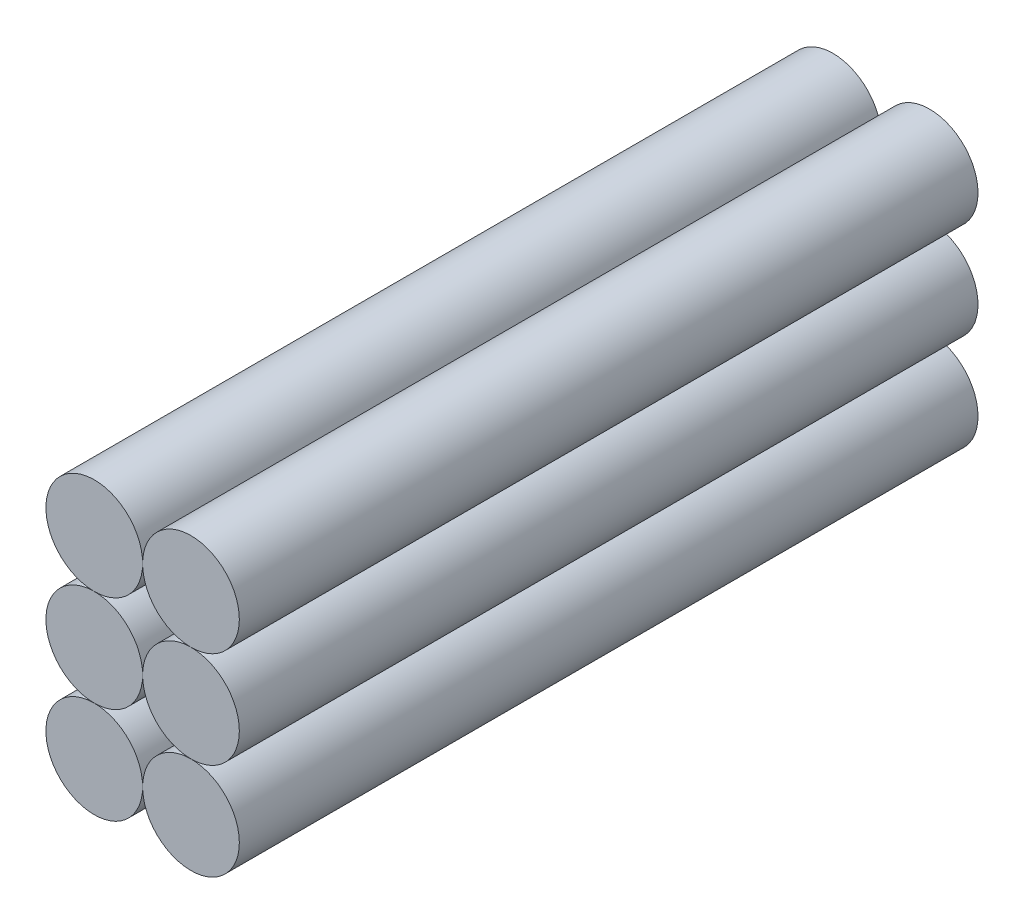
ISO-10303-21;
HEADER;
FILE_DESCRIPTION(('STEP AP214'),'2;1');
FILE_NAME('part.step','',(''),(''),'','','');
FILE_SCHEMA(('AUTOMOTIVE_DESIGN { 1 0 10303 214 1 1 1 1 }'));
ENDSEC;
DATA;
#1=APPLICATION_CONTEXT('core data for automotive mechanical design processes');
#2=APPLICATION_PROTOCOL_DEFINITION('international standard','automotive_design',2000,#1);
#3=PRODUCT_CONTEXT('',#1,'mechanical');
#4=PRODUCT('Part','Part','',(#3));
#5=PRODUCT_RELATED_PRODUCT_CATEGORY('part','',(#4));
#6=PRODUCT_DEFINITION_FORMATION('','',#4);
#7=PRODUCT_DEFINITION_CONTEXT('part definition',#1,'design');
#8=PRODUCT_DEFINITION('design','',#6,#7);
#9=PRODUCT_DEFINITION_SHAPE('','',#8);
#10=(LENGTH_UNIT() NAMED_UNIT(*) SI_UNIT(.MILLI.,.METRE.));
#11=(NAMED_UNIT(*) PLANE_ANGLE_UNIT() SI_UNIT($,.RADIAN.));
#12=(NAMED_UNIT(*) SI_UNIT($,.STERADIAN.) SOLID_ANGLE_UNIT());
#13=UNCERTAINTY_MEASURE_WITH_UNIT(LENGTH_MEASURE(1.E-05),#10,'distance_accuracy_value','');
#14=(GEOMETRIC_REPRESENTATION_CONTEXT(3) GLOBAL_UNCERTAINTY_ASSIGNED_CONTEXT((#13)) GLOBAL_UNIT_ASSIGNED_CONTEXT((#10,
#11,#12)) REPRESENTATION_CONTEXT('',''));
#15=CARTESIAN_POINT('',(0.,0.,0.));
#16=DIRECTION('',(0.,0.,1.));
#17=DIRECTION('',(1.,0.,0.));
#18=AXIS2_PLACEMENT_3D('',#15,#16,#17);
#19=CARTESIAN_POINT('',(8.9789,-17.9578,68.58));
#20=DIRECTION('',(0.,0.,-1.));
#21=DIRECTION('',(-1.,0.,0.));
#22=AXIS2_PLACEMENT_3D('',#19,#20,#21);
#23=CYLINDRICAL_SURFACE('',#22,8.9789);
#24=CARTESIAN_POINT('',(8.9789,-17.9578,68.58));
#25=DIRECTION('',(0.,0.,1.));
#26=DIRECTION('',(1.,0.,0.));
#27=AXIS2_PLACEMENT_3D('',#24,#25,#26);
#28=CIRCLE('',#27,8.9789);
#29=CARTESIAN_POINT('',(17.9578,-17.9578,68.58));
#30=VERTEX_POINT('',#29);
#31=EDGE_CURVE('E12',#30,#30,#28,.T.);
#32=ORIENTED_EDGE('',*,*,#31,.F.);
#33=EDGE_LOOP('',(#32));
#34=FACE_BOUND('',#33,.T.);
#35=CARTESIAN_POINT('',(8.9789,-17.9578,-68.58));
#36=DIRECTION('',(0.,0.,1.));
#37=DIRECTION('',(1.,0.,0.));
#38=AXIS2_PLACEMENT_3D('',#35,#36,#37);
#39=CIRCLE('',#38,8.9789);
#40=CARTESIAN_POINT('',(17.9578,-17.9578,-68.58));
#41=VERTEX_POINT('',#40);
#42=EDGE_CURVE('E52',#41,#41,#39,.T.);
#43=ORIENTED_EDGE('',*,*,#42,.T.);
#44=EDGE_LOOP('',(#43));
#45=FACE_BOUND('',#44,.T.);
#46=ADVANCED_FACE('F49',(#34,#45),#23,.T.);
#47=CARTESIAN_POINT('',(0.,0.,68.58));
#48=DIRECTION('',(0.,0.,1.));
#49=DIRECTION('',(1.,0.,0.));
#50=AXIS2_PLACEMENT_3D('',#47,#48,#49);
#51=PLANE('',#50);
#52=ORIENTED_EDGE('',*,*,#31,.T.);
#53=EDGE_LOOP('',(#52));
#54=FACE_BOUND('',#53,.T.);
#55=ADVANCED_FACE('F64',(#54),#51,.T.);
#56=CARTESIAN_POINT('',(0.,0.,-68.58));
#57=DIRECTION('',(0.,0.,1.));
#58=DIRECTION('',(1.,0.,0.));
#59=AXIS2_PLACEMENT_3D('',#56,#57,#58);
#60=PLANE('',#59);
#61=ORIENTED_EDGE('',*,*,#42,.F.);
#62=EDGE_LOOP('',(#61));
#63=FACE_BOUND('',#62,.T.);
#64=ADVANCED_FACE('F62',(#63),#60,.F.);
#65=CLOSED_SHELL('',(#46,#55,#64));
#66=MANIFOLD_SOLID_BREP('B2',#65);
#67=CARTESIAN_POINT('',(-8.9789,-17.9578,68.58));
#68=DIRECTION('',(0.,0.,-1.));
#69=DIRECTION('',(-1.,0.,0.));
#70=AXIS2_PLACEMENT_3D('',#67,#68,#69);
#71=CYLINDRICAL_SURFACE('',#70,8.9789);
#72=CARTESIAN_POINT('',(-8.9789,-17.9578,68.58));
#73=DIRECTION('',(0.,0.,1.));
#74=DIRECTION('',(1.,0.,0.));
#75=AXIS2_PLACEMENT_3D('',#72,#73,#74);
#76=CIRCLE('',#75,8.9789);
#77=CARTESIAN_POINT('',(0.,-17.9578,68.58));
#78=VERTEX_POINT('',#77);
#79=EDGE_CURVE('E48',#78,#78,#76,.T.);
#80=ORIENTED_EDGE('',*,*,#79,.F.);
#81=EDGE_LOOP('',(#80));
#82=FACE_BOUND('',#81,.T.);
#83=CARTESIAN_POINT('',(-8.9789,-17.9578,-68.58));
#84=DIRECTION('',(0.,0.,1.));
#85=DIRECTION('',(1.,0.,0.));
#86=AXIS2_PLACEMENT_3D('',#83,#84,#85);
#87=CIRCLE('',#86,8.9789);
#88=CARTESIAN_POINT('',(0.,-17.9578,-68.58));
#89=VERTEX_POINT('',#88);
#90=EDGE_CURVE('E100',#89,#89,#87,.T.);
#91=ORIENTED_EDGE('',*,*,#90,.T.);
#92=EDGE_LOOP('',(#91));
#93=FACE_BOUND('',#92,.T.);
#94=ADVANCED_FACE('F97',(#82,#93),#71,.T.);
#95=CARTESIAN_POINT('',(0.,0.,68.58));
#96=DIRECTION('',(0.,0.,1.));
#97=DIRECTION('',(1.,0.,0.));
#98=AXIS2_PLACEMENT_3D('',#95,#96,#97);
#99=PLANE('',#98);
#100=ORIENTED_EDGE('',*,*,#79,.T.);
#101=EDGE_LOOP('',(#100));
#102=FACE_BOUND('',#101,.T.);
#103=ADVANCED_FACE('F112',(#102),#99,.T.);
#104=CARTESIAN_POINT('',(0.,0.,-68.58));
#105=DIRECTION('',(0.,0.,1.));
#106=DIRECTION('',(1.,0.,0.));
#107=AXIS2_PLACEMENT_3D('',#104,#105,#106);
#108=PLANE('',#107);
#109=ORIENTED_EDGE('',*,*,#90,.F.);
#110=EDGE_LOOP('',(#109));
#111=FACE_BOUND('',#110,.T.);
#112=ADVANCED_FACE('F110',(#111),#108,.F.);
#113=CLOSED_SHELL('',(#94,#103,#112));
#114=MANIFOLD_SOLID_BREP('B7',#113);
#115=CARTESIAN_POINT('',(-8.9789,0.,68.58));
#116=DIRECTION('',(0.,0.,-1.));
#117=DIRECTION('',(-1.,0.,0.));
#118=AXIS2_PLACEMENT_3D('',#115,#116,#117);
#119=CYLINDRICAL_SURFACE('',#118,8.9789);
#120=CARTESIAN_POINT('',(-8.9789,0.,68.58));
#121=DIRECTION('',(0.,0.,1.));
#122=DIRECTION('',(1.,0.,0.));
#123=AXIS2_PLACEMENT_3D('',#120,#121,#122);
#124=CIRCLE('',#123,8.9789);
#125=CARTESIAN_POINT('',(0.,0.,68.58));
#126=VERTEX_POINT('',#125);
#127=EDGE_CURVE('E96',#126,#126,#124,.T.);
#128=ORIENTED_EDGE('',*,*,#127,.F.);
#129=EDGE_LOOP('',(#128));
#130=FACE_BOUND('',#129,.T.);
#131=CARTESIAN_POINT('',(-8.9789,0.,-68.58));
#132=DIRECTION('',(0.,0.,1.));
#133=DIRECTION('',(1.,0.,0.));
#134=AXIS2_PLACEMENT_3D('',#131,#132,#133);
#135=CIRCLE('',#134,8.9789);
#136=CARTESIAN_POINT('',(0.,0.,-68.58));
#137=VERTEX_POINT('',#136);
#138=EDGE_CURVE('E148',#137,#137,#135,.T.);
#139=ORIENTED_EDGE('',*,*,#138,.T.);
#140=EDGE_LOOP('',(#139));
#141=FACE_BOUND('',#140,.T.);
#142=ADVANCED_FACE('F145',(#130,#141),#119,.T.);
#143=CARTESIAN_POINT('',(0.,0.,68.58));
#144=DIRECTION('',(0.,0.,1.));
#145=DIRECTION('',(1.,0.,0.));
#146=AXIS2_PLACEMENT_3D('',#143,#144,#145);
#147=PLANE('',#146);
#148=ORIENTED_EDGE('',*,*,#127,.T.);
#149=EDGE_LOOP('',(#148));
#150=FACE_BOUND('',#149,.T.);
#151=ADVANCED_FACE('F160',(#150),#147,.T.);
#152=CARTESIAN_POINT('',(0.,0.,-68.58));
#153=DIRECTION('',(0.,0.,1.));
#154=DIRECTION('',(1.,0.,0.));
#155=AXIS2_PLACEMENT_3D('',#152,#153,#154);
#156=PLANE('',#155);
#157=ORIENTED_EDGE('',*,*,#138,.F.);
#158=EDGE_LOOP('',(#157));
#159=FACE_BOUND('',#158,.T.);
#160=ADVANCED_FACE('F158',(#159),#156,.F.);
#161=CLOSED_SHELL('',(#142,#151,#160));
#162=MANIFOLD_SOLID_BREP('B43',#161);
#163=CARTESIAN_POINT('',(8.9789,0.,68.58));
#164=DIRECTION('',(0.,0.,-1.));
#165=DIRECTION('',(-1.,0.,0.));
#166=AXIS2_PLACEMENT_3D('',#163,#164,#165);
#167=CYLINDRICAL_SURFACE('',#166,8.9789);
#168=CARTESIAN_POINT('',(8.9789,0.,68.58));
#169=DIRECTION('',(0.,0.,1.));
#170=DIRECTION('',(1.,0.,0.));
#171=AXIS2_PLACEMENT_3D('',#168,#169,#170);
#172=CIRCLE('',#171,8.9789);
#173=CARTESIAN_POINT('',(17.9578,0.,68.58));
#174=VERTEX_POINT('',#173);
#175=EDGE_CURVE('E144',#174,#174,#172,.T.);
#176=ORIENTED_EDGE('',*,*,#175,.F.);
#177=EDGE_LOOP('',(#176));
#178=FACE_BOUND('',#177,.T.);
#179=CARTESIAN_POINT('',(8.9789,0.,-68.58));
#180=DIRECTION('',(0.,0.,1.));
#181=DIRECTION('',(1.,0.,0.));
#182=AXIS2_PLACEMENT_3D('',#179,#180,#181);
#183=CIRCLE('',#182,8.9789);
#184=CARTESIAN_POINT('',(17.9578,0.,-68.58));
#185=VERTEX_POINT('',#184);
#186=EDGE_CURVE('E196',#185,#185,#183,.T.);
#187=ORIENTED_EDGE('',*,*,#186,.T.);
#188=EDGE_LOOP('',(#187));
#189=FACE_BOUND('',#188,.T.);
#190=ADVANCED_FACE('F193',(#178,#189),#167,.T.);
#191=CARTESIAN_POINT('',(0.,0.,68.58));
#192=DIRECTION('',(0.,0.,1.));
#193=DIRECTION('',(1.,0.,0.));
#194=AXIS2_PLACEMENT_3D('',#191,#192,#193);
#195=PLANE('',#194);
#196=ORIENTED_EDGE('',*,*,#175,.T.);
#197=EDGE_LOOP('',(#196));
#198=FACE_BOUND('',#197,.T.);
#199=ADVANCED_FACE('F208',(#198),#195,.T.);
#200=CARTESIAN_POINT('',(0.,0.,-68.58));
#201=DIRECTION('',(0.,0.,1.));
#202=DIRECTION('',(1.,0.,0.));
#203=AXIS2_PLACEMENT_3D('',#200,#201,#202);
#204=PLANE('',#203);
#205=ORIENTED_EDGE('',*,*,#186,.F.);
#206=EDGE_LOOP('',(#205));
#207=FACE_BOUND('',#206,.T.);
#208=ADVANCED_FACE('F206',(#207),#204,.F.);
#209=CLOSED_SHELL('',(#190,#199,#208));
#210=MANIFOLD_SOLID_BREP('B91',#209);
#211=CARTESIAN_POINT('',(8.9789,17.9578,68.58));
#212=DIRECTION('',(0.,0.,-1.));
#213=DIRECTION('',(-1.,0.,0.));
#214=AXIS2_PLACEMENT_3D('',#211,#212,#213);
#215=CYLINDRICAL_SURFACE('',#214,8.9789);
#216=CARTESIAN_POINT('',(8.9789,17.9578,68.58));
#217=DIRECTION('',(0.,0.,1.));
#218=DIRECTION('',(1.,0.,0.));
#219=AXIS2_PLACEMENT_3D('',#216,#217,#218);
#220=CIRCLE('',#219,8.9789);
#221=CARTESIAN_POINT('',(17.9578,17.9578,68.58));
#222=VERTEX_POINT('',#221);
#223=EDGE_CURVE('E192',#222,#222,#220,.T.);
#224=ORIENTED_EDGE('',*,*,#223,.F.);
#225=EDGE_LOOP('',(#224));
#226=FACE_BOUND('',#225,.T.);
#227=CARTESIAN_POINT('',(8.9789,17.9578,-68.58));
#228=DIRECTION('',(0.,0.,1.));
#229=DIRECTION('',(1.,0.,0.));
#230=AXIS2_PLACEMENT_3D('',#227,#228,#229);
#231=CIRCLE('',#230,8.9789);
#232=CARTESIAN_POINT('',(17.9578,17.9578,-68.58));
#233=VERTEX_POINT('',#232);
#234=EDGE_CURVE('E243',#233,#233,#231,.T.);
#235=ORIENTED_EDGE('',*,*,#234,.T.);
#236=EDGE_LOOP('',(#235));
#237=FACE_BOUND('',#236,.T.);
#238=ADVANCED_FACE('F240',(#226,#237),#215,.T.);
#239=CARTESIAN_POINT('',(0.,0.,68.58));
#240=DIRECTION('',(0.,0.,1.));
#241=DIRECTION('',(1.,0.,0.));
#242=AXIS2_PLACEMENT_3D('',#239,#240,#241);
#243=PLANE('',#242);
#244=ORIENTED_EDGE('',*,*,#223,.T.);
#245=EDGE_LOOP('',(#244));
#246=FACE_BOUND('',#245,.T.);
#247=ADVANCED_FACE('F255',(#246),#243,.T.);
#248=CARTESIAN_POINT('',(0.,0.,-68.58));
#249=DIRECTION('',(0.,0.,1.));
#250=DIRECTION('',(1.,0.,0.));
#251=AXIS2_PLACEMENT_3D('',#248,#249,#250);
#252=PLANE('',#251);
#253=ORIENTED_EDGE('',*,*,#234,.F.);
#254=EDGE_LOOP('',(#253));
#255=FACE_BOUND('',#254,.T.);
#256=ADVANCED_FACE('F253',(#255),#252,.F.);
#257=CLOSED_SHELL('',(#238,#247,#256));
#258=MANIFOLD_SOLID_BREP('B139',#257);
#259=CARTESIAN_POINT('',(-8.9789,17.9578,68.58));
#260=DIRECTION('',(0.,0.,-1.));
#261=DIRECTION('',(-1.,0.,0.));
#262=AXIS2_PLACEMENT_3D('',#259,#260,#261);
#263=CYLINDRICAL_SURFACE('',#262,8.9789);
#264=CARTESIAN_POINT('',(-8.9789,17.9578,68.58));
#265=DIRECTION('',(0.,0.,1.));
#266=DIRECTION('',(1.,0.,0.));
#267=AXIS2_PLACEMENT_3D('',#264,#265,#266);
#268=CIRCLE('',#267,8.9789);
#269=CARTESIAN_POINT('',(0.,17.9578,68.58));
#270=VERTEX_POINT('',#269);
#271=EDGE_CURVE('E239',#270,#270,#268,.T.);
#272=ORIENTED_EDGE('',*,*,#271,.F.);
#273=EDGE_LOOP('',(#272));
#274=FACE_BOUND('',#273,.T.);
#275=CARTESIAN_POINT('',(-8.9789,17.9578,-68.58));
#276=DIRECTION('',(0.,0.,1.));
#277=DIRECTION('',(1.,0.,0.));
#278=AXIS2_PLACEMENT_3D('',#275,#276,#277);
#279=CIRCLE('',#278,8.9789);
#280=CARTESIAN_POINT('',(0.,17.9578,-68.58));
#281=VERTEX_POINT('',#280);
#282=EDGE_CURVE('E283',#281,#281,#279,.T.);
#283=ORIENTED_EDGE('',*,*,#282,.T.);
#284=EDGE_LOOP('',(#283));
#285=FACE_BOUND('',#284,.T.);
#286=ADVANCED_FACE('F280',(#274,#285),#263,.T.);
#287=CARTESIAN_POINT('',(0.,0.,68.58));
#288=DIRECTION('',(0.,0.,1.));
#289=DIRECTION('',(1.,0.,0.));
#290=AXIS2_PLACEMENT_3D('',#287,#288,#289);
#291=PLANE('',#290);
#292=ORIENTED_EDGE('',*,*,#271,.T.);
#293=EDGE_LOOP('',(#292));
#294=FACE_BOUND('',#293,.T.);
#295=ADVANCED_FACE('F295',(#294),#291,.T.);
#296=CARTESIAN_POINT('',(0.,0.,-68.58));
#297=DIRECTION('',(0.,0.,1.));
#298=DIRECTION('',(1.,0.,0.));
#299=AXIS2_PLACEMENT_3D('',#296,#297,#298);
#300=PLANE('',#299);
#301=ORIENTED_EDGE('',*,*,#282,.F.);
#302=EDGE_LOOP('',(#301));
#303=FACE_BOUND('',#302,.T.);
#304=ADVANCED_FACE('F293',(#303),#300,.F.);
#305=CLOSED_SHELL('',(#286,#295,#304));
#306=MANIFOLD_SOLID_BREP('B187',#305);
#307=ADVANCED_BREP_SHAPE_REPRESENTATION('',(#18,#66,#114,#162,#210,#258,#306),#14);
#308=SHAPE_DEFINITION_REPRESENTATION(#9,#307);
ENDSEC;
END-ISO-10303-21;
